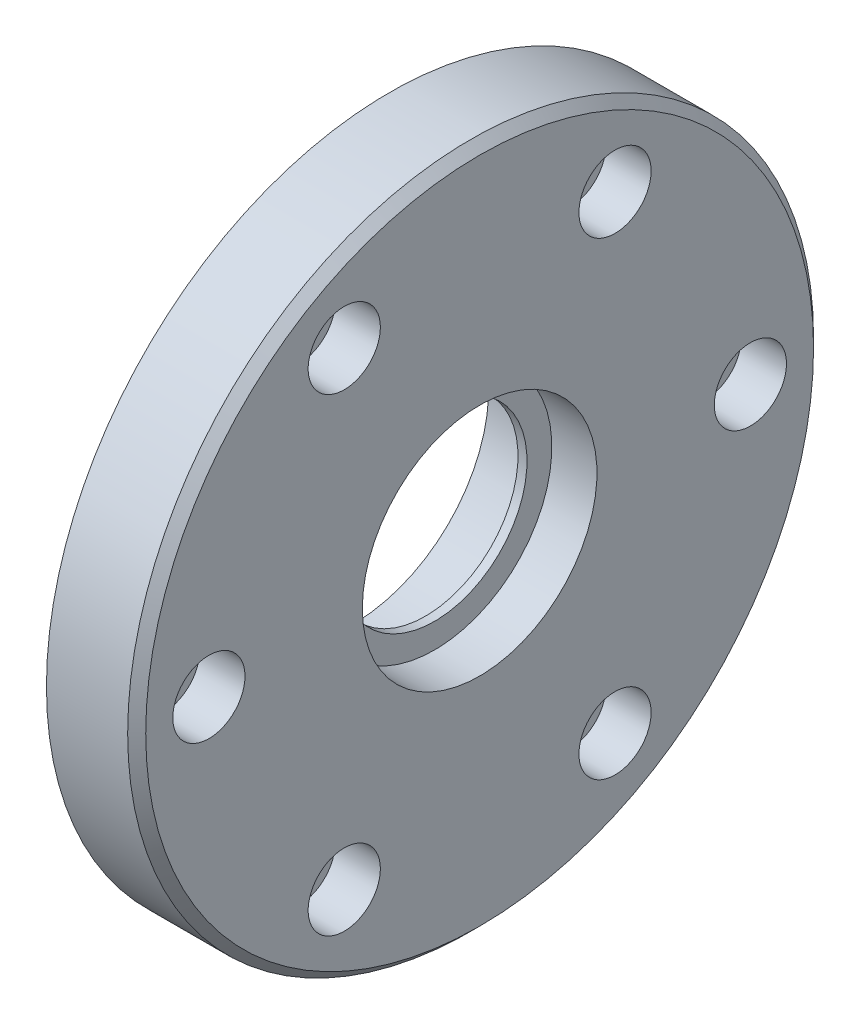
ISO-10303-21;
HEADER;
FILE_DESCRIPTION(('STEP AP214'),'2;1');
FILE_NAME('part.step','',(''),(''),'','','');
FILE_SCHEMA(('AUTOMOTIVE_DESIGN { 1 0 10303 214 1 1 1 1 }'));
ENDSEC;
DATA;
#1=APPLICATION_CONTEXT('core data for automotive mechanical design processes');
#2=APPLICATION_PROTOCOL_DEFINITION('international standard','automotive_design',2000,#1);
#3=PRODUCT_CONTEXT('',#1,'mechanical');
#4=PRODUCT('Part','Part','',(#3));
#5=PRODUCT_RELATED_PRODUCT_CATEGORY('part','',(#4));
#6=PRODUCT_DEFINITION_FORMATION('','',#4);
#7=PRODUCT_DEFINITION_CONTEXT('part definition',#1,'design');
#8=PRODUCT_DEFINITION('design','',#6,#7);
#9=PRODUCT_DEFINITION_SHAPE('','',#8);
#10=(LENGTH_UNIT() NAMED_UNIT(*) SI_UNIT(.MILLI.,.METRE.));
#11=(NAMED_UNIT(*) PLANE_ANGLE_UNIT() SI_UNIT($,.RADIAN.));
#12=(NAMED_UNIT(*) SI_UNIT($,.STERADIAN.) SOLID_ANGLE_UNIT());
#13=UNCERTAINTY_MEASURE_WITH_UNIT(LENGTH_MEASURE(1.E-05),#10,'distance_accuracy_value','');
#14=(GEOMETRIC_REPRESENTATION_CONTEXT(3) GLOBAL_UNCERTAINTY_ASSIGNED_CONTEXT((#13)) GLOBAL_UNIT_ASSIGNED_CONTEXT((#10,
#11,#12)) REPRESENTATION_CONTEXT('',''));
#15=CARTESIAN_POINT('',(0.,0.,0.));
#16=DIRECTION('',(0.,0.,1.));
#17=DIRECTION('',(1.,0.,0.));
#18=AXIS2_PLACEMENT_3D('',#15,#16,#17);
#19=CARTESIAN_POINT('',(-4.,25.,0.));
#20=DIRECTION('',(1.,0.,0.));
#21=DIRECTION('',(0.,0.,-1.));
#22=AXIS2_PLACEMENT_3D('',#19,#20,#21);
#23=PLANE('',#22);
#24=CARTESIAN_POINT('',(-4.,0.,0.));
#25=DIRECTION('',(1.,0.,0.));
#26=DIRECTION('',(0.,0.,-1.));
#27=AXIS2_PLACEMENT_3D('',#24,#25,#26);
#28=CIRCLE('',#27,24.5);
#29=CARTESIAN_POINT('',(-4.,0.,-24.5));
#30=VERTEX_POINT('',#29);
#31=EDGE_CURVE('E40',#30,#30,#28,.F.);
#32=ORIENTED_EDGE('',*,*,#31,.T.);
#33=EDGE_LOOP('',(#32));
#34=FACE_BOUND('',#33,.T.);
#35=CARTESIAN_POINT('',(-4.,0.,0.));
#36=DIRECTION('',(-1.,0.,0.));
#37=DIRECTION('',(0.,0.,1.));
#38=AXIS2_PLACEMENT_3D('',#35,#36,#37);
#39=CIRCLE('',#38,15.);
#40=CARTESIAN_POINT('',(-4.,0.,15.));
#41=VERTEX_POINT('',#40);
#42=EDGE_CURVE('E84',#41,#41,#39,.T.);
#43=ORIENTED_EDGE('',*,*,#42,.F.);
#44=EDGE_LOOP('',(#43));
#45=FACE_BOUND('',#44,.T.);
#46=ADVANCED_FACE('F33',(#34,#45),#23,.F.);
#47=CARTESIAN_POINT('',(0.,0.,0.));
#48=DIRECTION('',(-1.,0.,0.));
#49=DIRECTION('',(0.,0.,1.));
#50=AXIS2_PLACEMENT_3D('',#47,#48,#49);
#51=CYLINDRICAL_SURFACE('',#50,15.);
#52=CARTESIAN_POINT('',(4.,0.,0.));
#53=DIRECTION('',(-1.,0.,0.));
#54=DIRECTION('',(0.,0.,1.));
#55=AXIS2_PLACEMENT_3D('',#52,#53,#54);
#56=CIRCLE('',#55,15.);
#57=CARTESIAN_POINT('',(4.,0.,15.));
#58=VERTEX_POINT('',#57);
#59=EDGE_CURVE('E87',#58,#58,#56,.T.);
#60=ORIENTED_EDGE('',*,*,#59,.F.);
#61=EDGE_LOOP('',(#60));
#62=FACE_BOUND('',#61,.T.);
#63=ORIENTED_EDGE('',*,*,#42,.T.);
#64=EDGE_LOOP('',(#63));
#65=FACE_BOUND('',#64,.T.);
#66=ADVANCED_FACE('F219',(#62,#65),#51,.F.);
#67=CARTESIAN_POINT('',(4.,15.,0.));
#68=DIRECTION('',(1.,0.,0.));
#69=DIRECTION('',(0.,0.,-1.));
#70=AXIS2_PLACEMENT_3D('',#67,#68,#69);
#71=PLANE('',#70);
#72=CARTESIAN_POINT('',(4.,0.,0.));
#73=DIRECTION('',(-1.,0.,0.));
#74=DIRECTION('',(0.,0.,1.));
#75=AXIS2_PLACEMENT_3D('',#72,#73,#74);
#76=CIRCLE('',#75,10.25);
#77=CARTESIAN_POINT('',(4.,0.,10.25));
#78=VERTEX_POINT('',#77);
#79=EDGE_CURVE('E90',#78,#78,#76,.T.);
#80=ORIENTED_EDGE('',*,*,#79,.F.);
#81=EDGE_LOOP('',(#80));
#82=FACE_BOUND('',#81,.T.);
#83=ORIENTED_EDGE('',*,*,#59,.T.);
#84=EDGE_LOOP('',(#83));
#85=FACE_BOUND('',#84,.T.);
#86=ADVANCED_FACE('F213',(#82,#85),#71,.F.);
#87=CARTESIAN_POINT('',(0.,0.,0.));
#88=DIRECTION('',(-1.,0.,0.));
#89=DIRECTION('',(0.,0.,1.));
#90=AXIS2_PLACEMENT_3D('',#87,#88,#89);
#91=CYLINDRICAL_SURFACE('',#90,10.25);
#92=CARTESIAN_POINT('',(5.,0.,0.));
#93=DIRECTION('',(-1.,0.,0.));
#94=DIRECTION('',(0.,0.,1.));
#95=AXIS2_PLACEMENT_3D('',#92,#93,#94);
#96=CIRCLE('',#95,10.25);
#97=CARTESIAN_POINT('',(5.,0.,10.25));
#98=VERTEX_POINT('',#97);
#99=EDGE_CURVE('E93',#98,#98,#96,.T.);
#100=ORIENTED_EDGE('',*,*,#99,.F.);
#101=EDGE_LOOP('',(#100));
#102=FACE_BOUND('',#101,.T.);
#103=ORIENTED_EDGE('',*,*,#79,.T.);
#104=EDGE_LOOP('',(#103));
#105=FACE_BOUND('',#104,.T.);
#106=ADVANCED_FACE('F207',(#102,#105),#91,.F.);
#107=CARTESIAN_POINT('',(5.,10.25,0.));
#108=DIRECTION('',(-1.,0.,0.));
#109=DIRECTION('',(0.,0.,1.));
#110=AXIS2_PLACEMENT_3D('',#107,#108,#109);
#111=PLANE('',#110);
#112=CARTESIAN_POINT('',(5.,0.,0.));
#113=DIRECTION('',(-1.,0.,0.));
#114=DIRECTION('',(0.,0.,1.));
#115=AXIS2_PLACEMENT_3D('',#112,#113,#114);
#116=CIRCLE('',#115,13.);
#117=CARTESIAN_POINT('',(5.,0.,13.));
#118=VERTEX_POINT('',#117);
#119=EDGE_CURVE('E96',#118,#118,#116,.T.);
#120=ORIENTED_EDGE('',*,*,#119,.F.);
#121=EDGE_LOOP('',(#120));
#122=FACE_BOUND('',#121,.T.);
#123=ORIENTED_EDGE('',*,*,#99,.T.);
#124=EDGE_LOOP('',(#123));
#125=FACE_BOUND('',#124,.T.);
#126=ADVANCED_FACE('F201',(#122,#125),#111,.F.);
#127=CARTESIAN_POINT('',(0.,0.,0.));
#128=DIRECTION('',(-1.,0.,0.));
#129=DIRECTION('',(0.,0.,1.));
#130=AXIS2_PLACEMENT_3D('',#127,#128,#129);
#131=CYLINDRICAL_SURFACE('',#130,13.);
#132=CARTESIAN_POINT('',(10.,0.,0.));
#133=DIRECTION('',(-1.,0.,0.));
#134=DIRECTION('',(0.,0.,1.));
#135=AXIS2_PLACEMENT_3D('',#132,#133,#134);
#136=CIRCLE('',#135,13.);
#137=CARTESIAN_POINT('',(10.,0.,13.));
#138=VERTEX_POINT('',#137);
#139=EDGE_CURVE('E99',#138,#138,#136,.T.);
#140=ORIENTED_EDGE('',*,*,#139,.F.);
#141=EDGE_LOOP('',(#140));
#142=FACE_BOUND('',#141,.T.);
#143=ORIENTED_EDGE('',*,*,#119,.T.);
#144=EDGE_LOOP('',(#143));
#145=FACE_BOUND('',#144,.T.);
#146=ADVANCED_FACE('F183',(#142,#145),#131,.F.);
#147=CARTESIAN_POINT('',(10.,13.,0.));
#148=DIRECTION('',(-1.,0.,0.));
#149=DIRECTION('',(0.,0.,1.));
#150=AXIS2_PLACEMENT_3D('',#147,#148,#149);
#151=PLANE('',#150);
#152=CARTESIAN_POINT('',(10.,-25.980762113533,-15.0000000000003));
#153=DIRECTION('',(1.,0.,0.));
#154=DIRECTION('',(0.,0.,-1.));
#155=AXIS2_PLACEMENT_3D('',#152,#153,#154);
#156=CIRCLE('',#155,3.99999999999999);
#157=CARTESIAN_POINT('',(10.,-25.980762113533,-19.0000000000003));
#158=VERTEX_POINT('',#157);
#159=EDGE_CURVE('E56',#158,#158,#156,.T.);
#160=ORIENTED_EDGE('',*,*,#159,.F.);
#161=EDGE_LOOP('',(#160));
#162=FACE_BOUND('',#161,.T.);
#163=CARTESIAN_POINT('',(10.,-25.9807621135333,14.9999999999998));
#164=DIRECTION('',(1.,0.,0.));
#165=DIRECTION('',(0.,0.,-1.));
#166=AXIS2_PLACEMENT_3D('',#163,#164,#165);
#167=CIRCLE('',#166,3.99999999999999);
#168=CARTESIAN_POINT('',(10.,-25.9807621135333,10.9999999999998));
#169=VERTEX_POINT('',#168);
#170=EDGE_CURVE('E61',#169,#169,#167,.T.);
#171=ORIENTED_EDGE('',*,*,#170,.F.);
#172=EDGE_LOOP('',(#171));
#173=FACE_BOUND('',#172,.T.);
#174=CARTESIAN_POINT('',(10.,-2.09492430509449E-13,30.));
#175=DIRECTION('',(1.,0.,0.));
#176=DIRECTION('',(0.,0.,-1.));
#177=AXIS2_PLACEMENT_3D('',#174,#175,#176);
#178=CIRCLE('',#177,3.99999999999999);
#179=CARTESIAN_POINT('',(10.,-2.09492430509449E-13,26.));
#180=VERTEX_POINT('',#179);
#181=EDGE_CURVE('E66',#180,#180,#178,.T.);
#182=ORIENTED_EDGE('',*,*,#181,.F.);
#183=EDGE_LOOP('',(#182));
#184=FACE_BOUND('',#183,.T.);
#185=CARTESIAN_POINT('',(10.,25.9807621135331,15.0000000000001));
#186=DIRECTION('',(1.,0.,0.));
#187=DIRECTION('',(0.,0.,-1.));
#188=AXIS2_PLACEMENT_3D('',#185,#186,#187);
#189=CIRCLE('',#188,3.99999999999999);
#190=CARTESIAN_POINT('',(10.,25.9807621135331,11.0000000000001));
#191=VERTEX_POINT('',#190);
#192=EDGE_CURVE('E71',#191,#191,#189,.T.);
#193=ORIENTED_EDGE('',*,*,#192,.F.);
#194=EDGE_LOOP('',(#193));
#195=FACE_BOUND('',#194,.T.);
#196=CARTESIAN_POINT('',(10.,25.9807621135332,-14.9999999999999));
#197=DIRECTION('',(1.,0.,0.));
#198=DIRECTION('',(0.,0.,-1.));
#199=AXIS2_PLACEMENT_3D('',#196,#197,#198);
#200=CIRCLE('',#199,3.99999999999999);
#201=CARTESIAN_POINT('',(10.,25.9807621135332,-18.9999999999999));
#202=VERTEX_POINT('',#201);
#203=EDGE_CURVE('E76',#202,#202,#200,.T.);
#204=ORIENTED_EDGE('',*,*,#203,.F.);
#205=EDGE_LOOP('',(#204));
#206=FACE_BOUND('',#205,.T.);
#207=CARTESIAN_POINT('',(10.,0.,-30.));
#208=DIRECTION('',(1.,0.,0.));
#209=DIRECTION('',(0.,0.,-1.));
#210=AXIS2_PLACEMENT_3D('',#207,#208,#209);
#211=CIRCLE('',#210,3.99999999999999);
#212=CARTESIAN_POINT('',(10.,0.,-34.));
#213=VERTEX_POINT('',#212);
#214=EDGE_CURVE('E80',#213,#213,#211,.T.);
#215=ORIENTED_EDGE('',*,*,#214,.F.);
#216=EDGE_LOOP('',(#215));
#217=FACE_BOUND('',#216,.T.);
#218=CARTESIAN_POINT('',(10.,0.,0.));
#219=DIRECTION('',(-1.,0.,0.));
#220=DIRECTION('',(0.,0.,1.));
#221=AXIS2_PLACEMENT_3D('',#218,#219,#220);
#222=CIRCLE('',#221,37.);
#223=CARTESIAN_POINT('',(10.,0.,37.));
#224=VERTEX_POINT('',#223);
#225=EDGE_CURVE('E45',#224,#224,#222,.F.);
#226=ORIENTED_EDGE('',*,*,#225,.T.);
#227=EDGE_LOOP('',(#226));
#228=FACE_BOUND('',#227,.T.);
#229=ORIENTED_EDGE('',*,*,#139,.T.);
#230=EDGE_LOOP('',(#229));
#231=FACE_BOUND('',#230,.T.);
#232=ADVANCED_FACE('F179',(#162,#173,#184,#195,#206,#217,#228,#231),#151,.F.);
#233=CARTESIAN_POINT('',(0.,0.,0.));
#234=DIRECTION('',(-1.,0.,0.));
#235=DIRECTION('',(0.,0.,1.));
#236=AXIS2_PLACEMENT_3D('',#233,#234,#235);
#237=CYLINDRICAL_SURFACE('',#236,38.);
#238=CARTESIAN_POINT('',(9.,0.,0.));
#239=DIRECTION('',(-1.,0.,0.));
#240=DIRECTION('',(0.,0.,1.));
#241=AXIS2_PLACEMENT_3D('',#238,#239,#240);
#242=CIRCLE('',#241,38.);
#243=CARTESIAN_POINT('',(9.,0.,38.));
#244=VERTEX_POINT('',#243);
#245=EDGE_CURVE('E49',#244,#244,#242,.T.);
#246=ORIENTED_EDGE('',*,*,#245,.T.);
#247=EDGE_LOOP('',(#246));
#248=FACE_BOUND('',#247,.T.);
#249=CARTESIAN_POINT('',(0.,0.,0.));
#250=DIRECTION('',(-1.,0.,0.));
#251=DIRECTION('',(0.,0.,1.));
#252=AXIS2_PLACEMENT_3D('',#249,#250,#251);
#253=CIRCLE('',#252,38.);
#254=CARTESIAN_POINT('',(0.,0.,38.));
#255=VERTEX_POINT('',#254);
#256=EDGE_CURVE('E102',#255,#255,#253,.T.);
#257=ORIENTED_EDGE('',*,*,#256,.F.);
#258=EDGE_LOOP('',(#257));
#259=FACE_BOUND('',#258,.T.);
#260=ADVANCED_FACE('F182',(#248,#259),#237,.T.);
#261=CARTESIAN_POINT('',(0.,38.,0.));
#262=DIRECTION('',(1.,0.,0.));
#263=DIRECTION('',(0.,0.,-1.));
#264=AXIS2_PLACEMENT_3D('',#261,#262,#263);
#265=PLANE('',#264);
#266=CARTESIAN_POINT('',(0.,-25.980762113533,-15.0000000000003));
#267=DIRECTION('',(1.,0.,0.));
#268=DIRECTION('',(0.,0.,-1.));
#269=AXIS2_PLACEMENT_3D('',#266,#267,#268);
#270=CIRCLE('',#269,2.15);
#271=CARTESIAN_POINT('',(0.,-25.980762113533,-17.1500000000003));
#272=VERTEX_POINT('',#271);
#273=EDGE_CURVE('E52',#272,#272,#270,.T.);
#274=ORIENTED_EDGE('',*,*,#273,.T.);
#275=EDGE_LOOP('',(#274));
#276=FACE_BOUND('',#275,.T.);
#277=CARTESIAN_POINT('',(0.,-25.9807621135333,14.9999999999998));
#278=DIRECTION('',(1.,0.,0.));
#279=DIRECTION('',(0.,0.,-1.));
#280=AXIS2_PLACEMENT_3D('',#277,#278,#279);
#281=CIRCLE('',#280,2.15);
#282=CARTESIAN_POINT('',(0.,-25.9807621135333,12.8499999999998));
#283=VERTEX_POINT('',#282);
#284=EDGE_CURVE('E57',#283,#283,#281,.T.);
#285=ORIENTED_EDGE('',*,*,#284,.T.);
#286=EDGE_LOOP('',(#285));
#287=FACE_BOUND('',#286,.T.);
#288=CARTESIAN_POINT('',(0.,-2.09492430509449E-13,30.));
#289=DIRECTION('',(1.,0.,0.));
#290=DIRECTION('',(0.,0.,-1.));
#291=AXIS2_PLACEMENT_3D('',#288,#289,#290);
#292=CIRCLE('',#291,2.15);
#293=CARTESIAN_POINT('',(0.,-2.09492430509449E-13,27.85));
#294=VERTEX_POINT('',#293);
#295=EDGE_CURVE('E62',#294,#294,#292,.T.);
#296=ORIENTED_EDGE('',*,*,#295,.T.);
#297=EDGE_LOOP('',(#296));
#298=FACE_BOUND('',#297,.T.);
#299=CARTESIAN_POINT('',(0.,25.9807621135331,15.0000000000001));
#300=DIRECTION('',(1.,0.,0.));
#301=DIRECTION('',(0.,0.,-1.));
#302=AXIS2_PLACEMENT_3D('',#299,#300,#301);
#303=CIRCLE('',#302,2.15);
#304=CARTESIAN_POINT('',(0.,25.9807621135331,12.8500000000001));
#305=VERTEX_POINT('',#304);
#306=EDGE_CURVE('E67',#305,#305,#303,.T.);
#307=ORIENTED_EDGE('',*,*,#306,.T.);
#308=EDGE_LOOP('',(#307));
#309=FACE_BOUND('',#308,.T.);
#310=CARTESIAN_POINT('',(0.,25.9807621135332,-14.9999999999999));
#311=DIRECTION('',(1.,0.,0.));
#312=DIRECTION('',(0.,0.,-1.));
#313=AXIS2_PLACEMENT_3D('',#310,#311,#312);
#314=CIRCLE('',#313,2.15);
#315=CARTESIAN_POINT('',(0.,25.9807621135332,-17.1499999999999));
#316=VERTEX_POINT('',#315);
#317=EDGE_CURVE('E72',#316,#316,#314,.T.);
#318=ORIENTED_EDGE('',*,*,#317,.T.);
#319=EDGE_LOOP('',(#318));
#320=FACE_BOUND('',#319,.T.);
#321=CARTESIAN_POINT('',(0.,0.,-30.));
#322=DIRECTION('',(1.,0.,0.));
#323=DIRECTION('',(0.,0.,-1.));
#324=AXIS2_PLACEMENT_3D('',#321,#322,#323);
#325=CIRCLE('',#324,2.15);
#326=CARTESIAN_POINT('',(0.,0.,-32.15));
#327=VERTEX_POINT('',#326);
#328=EDGE_CURVE('E77',#327,#327,#325,.T.);
#329=ORIENTED_EDGE('',*,*,#328,.T.);
#330=EDGE_LOOP('',(#329));
#331=FACE_BOUND('',#330,.T.);
#332=CARTESIAN_POINT('',(0.,0.,0.));
#333=DIRECTION('',(-1.,0.,0.));
#334=DIRECTION('',(0.,0.,1.));
#335=AXIS2_PLACEMENT_3D('',#332,#333,#334);
#336=CIRCLE('',#335,25.);
#337=CARTESIAN_POINT('',(0.,0.,25.));
#338=VERTEX_POINT('',#337);
#339=EDGE_CURVE('E105',#338,#338,#336,.T.);
#340=ORIENTED_EDGE('',*,*,#339,.F.);
#341=EDGE_LOOP('',(#340));
#342=FACE_BOUND('',#341,.T.);
#343=ORIENTED_EDGE('',*,*,#256,.T.);
#344=EDGE_LOOP('',(#343));
#345=FACE_BOUND('',#344,.T.);
#346=ADVANCED_FACE('F260',(#276,#287,#298,#309,#320,#331,#342,#345),#265,.F.);
#347=CARTESIAN_POINT('',(0.,0.,0.));
#348=DIRECTION('',(-1.,0.,0.));
#349=DIRECTION('',(0.,0.,1.));
#350=AXIS2_PLACEMENT_3D('',#347,#348,#349);
#351=CYLINDRICAL_SURFACE('',#350,25.);
#352=CARTESIAN_POINT('',(-1.,0.,0.));
#353=DIRECTION('',(-1.,0.,0.));
#354=DIRECTION('',(0.,0.,1.));
#355=AXIS2_PLACEMENT_3D('',#352,#353,#354);
#356=CIRCLE('',#355,25.);
#357=CARTESIAN_POINT('',(-1.,0.,25.));
#358=VERTEX_POINT('',#357);
#359=EDGE_CURVE('E108',#358,#358,#356,.T.);
#360=ORIENTED_EDGE('',*,*,#359,.F.);
#361=EDGE_LOOP('',(#360));
#362=FACE_BOUND('',#361,.T.);
#363=ORIENTED_EDGE('',*,*,#339,.T.);
#364=EDGE_LOOP('',(#363));
#365=FACE_BOUND('',#364,.T.);
#366=ADVANCED_FACE('F268',(#362,#365),#351,.T.);
#367=CARTESIAN_POINT('',(-1.,25.,0.));
#368=DIRECTION('',(1.,0.,0.));
#369=DIRECTION('',(0.,0.,-1.));
#370=AXIS2_PLACEMENT_3D('',#367,#368,#369);
#371=PLANE('',#370);
#372=CARTESIAN_POINT('',(-0.999999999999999,0.,0.));
#373=DIRECTION('',(-1.,0.,0.));
#374=DIRECTION('',(0.,0.,1.));
#375=AXIS2_PLACEMENT_3D('',#372,#373,#374);
#376=CIRCLE('',#375,24.);
#377=CARTESIAN_POINT('',(-0.999999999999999,0.,24.));
#378=VERTEX_POINT('',#377);
#379=EDGE_CURVE('E111',#378,#378,#376,.T.);
#380=ORIENTED_EDGE('',*,*,#379,.F.);
#381=EDGE_LOOP('',(#380));
#382=FACE_BOUND('',#381,.T.);
#383=ORIENTED_EDGE('',*,*,#359,.T.);
#384=EDGE_LOOP('',(#383));
#385=FACE_BOUND('',#384,.T.);
#386=ADVANCED_FACE('F276',(#382,#385),#371,.F.);
#387=CARTESIAN_POINT('',(0.,0.,0.));
#388=DIRECTION('',(-1.,0.,0.));
#389=DIRECTION('',(0.,0.,1.));
#390=AXIS2_PLACEMENT_3D('',#387,#388,#389);
#391=CYLINDRICAL_SURFACE('',#390,24.);
#392=CARTESIAN_POINT('',(-2.5,0.,0.));
#393=DIRECTION('',(-1.,0.,0.));
#394=DIRECTION('',(0.,0.,1.));
#395=AXIS2_PLACEMENT_3D('',#392,#393,#394);
#396=CIRCLE('',#395,24.);
#397=CARTESIAN_POINT('',(-2.5,0.,24.));
#398=VERTEX_POINT('',#397);
#399=EDGE_CURVE('E114',#398,#398,#396,.T.);
#400=ORIENTED_EDGE('',*,*,#399,.F.);
#401=EDGE_LOOP('',(#400));
#402=FACE_BOUND('',#401,.T.);
#403=ORIENTED_EDGE('',*,*,#379,.T.);
#404=EDGE_LOOP('',(#403));
#405=FACE_BOUND('',#404,.T.);
#406=ADVANCED_FACE('F284',(#402,#405),#391,.T.);
#407=CARTESIAN_POINT('',(-2.5,25.,0.));
#408=DIRECTION('',(-1.,0.,0.));
#409=DIRECTION('',(0.,0.,1.));
#410=AXIS2_PLACEMENT_3D('',#407,#408,#409);
#411=PLANE('',#410);
#412=CARTESIAN_POINT('',(-2.5,0.,0.));
#413=DIRECTION('',(-1.,0.,0.));
#414=DIRECTION('',(0.,0.,1.));
#415=AXIS2_PLACEMENT_3D('',#412,#413,#414);
#416=CIRCLE('',#415,25.);
#417=CARTESIAN_POINT('',(-2.5,0.,25.));
#418=VERTEX_POINT('',#417);
#419=EDGE_CURVE('E79',#418,#418,#416,.T.);
#420=ORIENTED_EDGE('',*,*,#419,.F.);
#421=EDGE_LOOP('',(#420));
#422=FACE_BOUND('',#421,.T.);
#423=ORIENTED_EDGE('',*,*,#399,.T.);
#424=EDGE_LOOP('',(#423));
#425=FACE_BOUND('',#424,.T.);
#426=ADVANCED_FACE('F292',(#422,#425),#411,.F.);
#427=CARTESIAN_POINT('',(0.,0.,0.));
#428=DIRECTION('',(-1.,0.,0.));
#429=DIRECTION('',(0.,0.,1.));
#430=AXIS2_PLACEMENT_3D('',#427,#428,#429);
#431=CYLINDRICAL_SURFACE('',#430,25.);
#432=CARTESIAN_POINT('',(-3.5,0.,0.));
#433=DIRECTION('',(1.,0.,0.));
#434=DIRECTION('',(0.,0.,-1.));
#435=AXIS2_PLACEMENT_3D('',#432,#433,#434);
#436=CIRCLE('',#435,25.);
#437=CARTESIAN_POINT('',(-3.5,0.,-25.));
#438=VERTEX_POINT('',#437);
#439=EDGE_CURVE('E10',#438,#438,#436,.T.);
#440=ORIENTED_EDGE('',*,*,#439,.T.);
#441=EDGE_LOOP('',(#440));
#442=FACE_BOUND('',#441,.T.);
#443=ORIENTED_EDGE('',*,*,#419,.T.);
#444=EDGE_LOOP('',(#443));
#445=FACE_BOUND('',#444,.T.);
#446=ADVANCED_FACE('F300',(#442,#445),#431,.T.);
#447=CARTESIAN_POINT('',(9.,0.,0.));
#448=DIRECTION('',(-1.,0.,0.));
#449=DIRECTION('',(0.,0.,1.));
#450=AXIS2_PLACEMENT_3D('',#447,#448,#449);
#451=CONICAL_SURFACE('',#450,38.,0.785398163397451);
#452=ORIENTED_EDGE('',*,*,#225,.F.);
#453=EDGE_LOOP('',(#452));
#454=FACE_BOUND('',#453,.T.);
#455=ORIENTED_EDGE('',*,*,#245,.F.);
#456=EDGE_LOOP('',(#455));
#457=FACE_BOUND('',#456,.T.);
#458=ADVANCED_FACE('F308',(#454,#457),#451,.T.);
#459=CARTESIAN_POINT('',(10.,0.,-30.));
#460=DIRECTION('',(1.,0.,0.));
#461=DIRECTION('',(0.,0.,-1.));
#462=AXIS2_PLACEMENT_3D('',#459,#460,#461);
#463=CYLINDRICAL_SURFACE('',#462,2.15);
#464=CARTESIAN_POINT('',(5.,0.,-30.));
#465=DIRECTION('',(1.,0.,0.));
#466=DIRECTION('',(0.,0.,-1.));
#467=AXIS2_PLACEMENT_3D('',#464,#465,#466);
#468=CIRCLE('',#467,2.15);
#469=CARTESIAN_POINT('',(5.,0.,-32.15));
#470=VERTEX_POINT('',#469);
#471=EDGE_CURVE('E75',#470,#470,#468,.T.);
#472=ORIENTED_EDGE('',*,*,#471,.T.);
#473=EDGE_LOOP('',(#472));
#474=FACE_BOUND('',#473,.T.);
#475=ORIENTED_EDGE('',*,*,#328,.F.);
#476=EDGE_LOOP('',(#475));
#477=FACE_BOUND('',#476,.T.);
#478=ADVANCED_FACE('F315',(#474,#477),#463,.F.);
#479=CARTESIAN_POINT('',(10.,0.,-30.));
#480=DIRECTION('',(1.,0.,0.));
#481=DIRECTION('',(0.,0.,-1.));
#482=AXIS2_PLACEMENT_3D('',#479,#480,#481);
#483=CYLINDRICAL_SURFACE('',#482,3.99999999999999);
#484=CARTESIAN_POINT('',(5.,0.,-30.));
#485=DIRECTION('',(1.,0.,0.));
#486=DIRECTION('',(0.,0.,-1.));
#487=AXIS2_PLACEMENT_3D('',#484,#485,#486);
#488=CIRCLE('',#487,4.);
#489=CARTESIAN_POINT('',(5.,0.,-34.));
#490=VERTEX_POINT('',#489);
#491=EDGE_CURVE('E121',#490,#490,#488,.T.);
#492=ORIENTED_EDGE('',*,*,#491,.F.);
#493=EDGE_LOOP('',(#492));
#494=FACE_BOUND('',#493,.T.);
#495=ORIENTED_EDGE('',*,*,#214,.T.);
#496=EDGE_LOOP('',(#495));
#497=FACE_BOUND('',#496,.T.);
#498=ADVANCED_FACE('F323',(#494,#497),#483,.F.);
#499=CARTESIAN_POINT('',(5.,2.15,-30.));
#500=DIRECTION('',(-1.,0.,0.));
#501=DIRECTION('',(0.,0.,1.));
#502=AXIS2_PLACEMENT_3D('',#499,#500,#501);
#503=PLANE('',#502);
#504=ORIENTED_EDGE('',*,*,#471,.F.);
#505=EDGE_LOOP('',(#504));
#506=FACE_BOUND('',#505,.T.);
#507=ORIENTED_EDGE('',*,*,#491,.T.);
#508=EDGE_LOOP('',(#507));
#509=FACE_BOUND('',#508,.T.);
#510=ADVANCED_FACE('F331',(#506,#509),#503,.F.);
#511=CARTESIAN_POINT('',(10.,25.9807621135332,-14.9999999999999));
#512=DIRECTION('',(1.,0.,0.));
#513=DIRECTION('',(0.,0.,-1.));
#514=AXIS2_PLACEMENT_3D('',#511,#512,#513);
#515=CYLINDRICAL_SURFACE('',#514,2.15);
#516=CARTESIAN_POINT('',(5.,25.9807621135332,-14.9999999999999));
#517=DIRECTION('',(1.,0.,0.));
#518=DIRECTION('',(0.,0.,-1.));
#519=AXIS2_PLACEMENT_3D('',#516,#517,#518);
#520=CIRCLE('',#519,2.15);
#521=CARTESIAN_POINT('',(5.,25.9807621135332,-17.1499999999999));
#522=VERTEX_POINT('',#521);
#523=EDGE_CURVE('E70',#522,#522,#520,.T.);
#524=ORIENTED_EDGE('',*,*,#523,.T.);
#525=EDGE_LOOP('',(#524));
#526=FACE_BOUND('',#525,.T.);
#527=ORIENTED_EDGE('',*,*,#317,.F.);
#528=EDGE_LOOP('',(#527));
#529=FACE_BOUND('',#528,.T.);
#530=ADVANCED_FACE('F339',(#526,#529),#515,.F.);
#531=CARTESIAN_POINT('',(10.,25.9807621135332,-14.9999999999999));
#532=DIRECTION('',(1.,0.,0.));
#533=DIRECTION('',(0.,0.,-1.));
#534=AXIS2_PLACEMENT_3D('',#531,#532,#533);
#535=CYLINDRICAL_SURFACE('',#534,3.99999999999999);
#536=CARTESIAN_POINT('',(5.,25.9807621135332,-14.9999999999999));
#537=DIRECTION('',(1.,0.,0.));
#538=DIRECTION('',(0.,0.,-1.));
#539=AXIS2_PLACEMENT_3D('',#536,#537,#538);
#540=CIRCLE('',#539,4.);
#541=CARTESIAN_POINT('',(5.,25.9807621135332,-18.9999999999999));
#542=VERTEX_POINT('',#541);
#543=EDGE_CURVE('E128',#542,#542,#540,.T.);
#544=ORIENTED_EDGE('',*,*,#543,.F.);
#545=EDGE_LOOP('',(#544));
#546=FACE_BOUND('',#545,.T.);
#547=ORIENTED_EDGE('',*,*,#203,.T.);
#548=EDGE_LOOP('',(#547));
#549=FACE_BOUND('',#548,.T.);
#550=ADVANCED_FACE('F347',(#546,#549),#535,.F.);
#551=CARTESIAN_POINT('',(5.,28.1307621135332,-14.9999999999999));
#552=DIRECTION('',(-1.,0.,0.));
#553=DIRECTION('',(0.,0.,1.));
#554=AXIS2_PLACEMENT_3D('',#551,#552,#553);
#555=PLANE('',#554);
#556=ORIENTED_EDGE('',*,*,#523,.F.);
#557=EDGE_LOOP('',(#556));
#558=FACE_BOUND('',#557,.T.);
#559=ORIENTED_EDGE('',*,*,#543,.T.);
#560=EDGE_LOOP('',(#559));
#561=FACE_BOUND('',#560,.T.);
#562=ADVANCED_FACE('F355',(#558,#561),#555,.F.);
#563=CARTESIAN_POINT('',(10.,25.9807621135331,15.0000000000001));
#564=DIRECTION('',(1.,0.,0.));
#565=DIRECTION('',(0.,0.,-1.));
#566=AXIS2_PLACEMENT_3D('',#563,#564,#565);
#567=CYLINDRICAL_SURFACE('',#566,2.15);
#568=CARTESIAN_POINT('',(5.,25.9807621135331,15.0000000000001));
#569=DIRECTION('',(1.,0.,0.));
#570=DIRECTION('',(0.,0.,-1.));
#571=AXIS2_PLACEMENT_3D('',#568,#569,#570);
#572=CIRCLE('',#571,2.15);
#573=CARTESIAN_POINT('',(5.,25.9807621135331,12.8500000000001));
#574=VERTEX_POINT('',#573);
#575=EDGE_CURVE('E65',#574,#574,#572,.T.);
#576=ORIENTED_EDGE('',*,*,#575,.T.);
#577=EDGE_LOOP('',(#576));
#578=FACE_BOUND('',#577,.T.);
#579=ORIENTED_EDGE('',*,*,#306,.F.);
#580=EDGE_LOOP('',(#579));
#581=FACE_BOUND('',#580,.T.);
#582=ADVANCED_FACE('F363',(#578,#581),#567,.F.);
#583=CARTESIAN_POINT('',(10.,25.9807621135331,15.0000000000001));
#584=DIRECTION('',(1.,0.,0.));
#585=DIRECTION('',(0.,0.,-1.));
#586=AXIS2_PLACEMENT_3D('',#583,#584,#585);
#587=CYLINDRICAL_SURFACE('',#586,3.99999999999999);
#588=CARTESIAN_POINT('',(5.,25.9807621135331,15.0000000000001));
#589=DIRECTION('',(1.,0.,0.));
#590=DIRECTION('',(0.,0.,-1.));
#591=AXIS2_PLACEMENT_3D('',#588,#589,#590);
#592=CIRCLE('',#591,4.);
#593=CARTESIAN_POINT('',(5.,25.9807621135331,11.0000000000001));
#594=VERTEX_POINT('',#593);
#595=EDGE_CURVE('E135',#594,#594,#592,.T.);
#596=ORIENTED_EDGE('',*,*,#595,.F.);
#597=EDGE_LOOP('',(#596));
#598=FACE_BOUND('',#597,.T.);
#599=ORIENTED_EDGE('',*,*,#192,.T.);
#600=EDGE_LOOP('',(#599));
#601=FACE_BOUND('',#600,.T.);
#602=ADVANCED_FACE('F371',(#598,#601),#587,.F.);
#603=CARTESIAN_POINT('',(5.,28.1307621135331,15.0000000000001));
#604=DIRECTION('',(-1.,0.,0.));
#605=DIRECTION('',(0.,0.,1.));
#606=AXIS2_PLACEMENT_3D('',#603,#604,#605);
#607=PLANE('',#606);
#608=ORIENTED_EDGE('',*,*,#575,.F.);
#609=EDGE_LOOP('',(#608));
#610=FACE_BOUND('',#609,.T.);
#611=ORIENTED_EDGE('',*,*,#595,.T.);
#612=EDGE_LOOP('',(#611));
#613=FACE_BOUND('',#612,.T.);
#614=ADVANCED_FACE('F379',(#610,#613),#607,.F.);
#615=CARTESIAN_POINT('',(10.,-2.09492430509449E-13,30.));
#616=DIRECTION('',(1.,0.,0.));
#617=DIRECTION('',(0.,0.,-1.));
#618=AXIS2_PLACEMENT_3D('',#615,#616,#617);
#619=CYLINDRICAL_SURFACE('',#618,2.15);
#620=CARTESIAN_POINT('',(5.,-2.09492430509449E-13,30.));
#621=DIRECTION('',(1.,0.,0.));
#622=DIRECTION('',(0.,0.,-1.));
#623=AXIS2_PLACEMENT_3D('',#620,#621,#622);
#624=CIRCLE('',#623,2.15);
#625=CARTESIAN_POINT('',(5.,-2.09492430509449E-13,27.85));
#626=VERTEX_POINT('',#625);
#627=EDGE_CURVE('E60',#626,#626,#624,.T.);
#628=ORIENTED_EDGE('',*,*,#627,.T.);
#629=EDGE_LOOP('',(#628));
#630=FACE_BOUND('',#629,.T.);
#631=ORIENTED_EDGE('',*,*,#295,.F.);
#632=EDGE_LOOP('',(#631));
#633=FACE_BOUND('',#632,.T.);
#634=ADVANCED_FACE('F387',(#630,#633),#619,.F.);
#635=CARTESIAN_POINT('',(10.,-2.09492430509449E-13,30.));
#636=DIRECTION('',(1.,0.,0.));
#637=DIRECTION('',(0.,0.,-1.));
#638=AXIS2_PLACEMENT_3D('',#635,#636,#637);
#639=CYLINDRICAL_SURFACE('',#638,3.99999999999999);
#640=CARTESIAN_POINT('',(5.,-2.09492430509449E-13,30.));
#641=DIRECTION('',(1.,0.,0.));
#642=DIRECTION('',(0.,0.,-1.));
#643=AXIS2_PLACEMENT_3D('',#640,#641,#642);
#644=CIRCLE('',#643,4.);
#645=CARTESIAN_POINT('',(5.,-2.09492430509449E-13,26.));
#646=VERTEX_POINT('',#645);
#647=EDGE_CURVE('E142',#646,#646,#644,.T.);
#648=ORIENTED_EDGE('',*,*,#647,.F.);
#649=EDGE_LOOP('',(#648));
#650=FACE_BOUND('',#649,.T.);
#651=ORIENTED_EDGE('',*,*,#181,.T.);
#652=EDGE_LOOP('',(#651));
#653=FACE_BOUND('',#652,.T.);
#654=ADVANCED_FACE('F395',(#650,#653),#639,.F.);
#655=CARTESIAN_POINT('',(5.,2.14999999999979,30.));
#656=DIRECTION('',(-1.,0.,0.));
#657=DIRECTION('',(0.,0.,1.));
#658=AXIS2_PLACEMENT_3D('',#655,#656,#657);
#659=PLANE('',#658);
#660=ORIENTED_EDGE('',*,*,#627,.F.);
#661=EDGE_LOOP('',(#660));
#662=FACE_BOUND('',#661,.T.);
#663=ORIENTED_EDGE('',*,*,#647,.T.);
#664=EDGE_LOOP('',(#663));
#665=FACE_BOUND('',#664,.T.);
#666=ADVANCED_FACE('F403',(#662,#665),#659,.F.);
#667=CARTESIAN_POINT('',(10.,-25.9807621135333,14.9999999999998));
#668=DIRECTION('',(1.,0.,0.));
#669=DIRECTION('',(0.,0.,-1.));
#670=AXIS2_PLACEMENT_3D('',#667,#668,#669);
#671=CYLINDRICAL_SURFACE('',#670,2.15);
#672=CARTESIAN_POINT('',(5.,-25.9807621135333,14.9999999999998));
#673=DIRECTION('',(1.,0.,0.));
#674=DIRECTION('',(0.,0.,-1.));
#675=AXIS2_PLACEMENT_3D('',#672,#673,#674);
#676=CIRCLE('',#675,2.15);
#677=CARTESIAN_POINT('',(5.,-25.9807621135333,12.8499999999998));
#678=VERTEX_POINT('',#677);
#679=EDGE_CURVE('E55',#678,#678,#676,.T.);
#680=ORIENTED_EDGE('',*,*,#679,.T.);
#681=EDGE_LOOP('',(#680));
#682=FACE_BOUND('',#681,.T.);
#683=ORIENTED_EDGE('',*,*,#284,.F.);
#684=EDGE_LOOP('',(#683));
#685=FACE_BOUND('',#684,.T.);
#686=ADVANCED_FACE('F411',(#682,#685),#671,.F.);
#687=CARTESIAN_POINT('',(10.,-25.9807621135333,14.9999999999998));
#688=DIRECTION('',(1.,0.,0.));
#689=DIRECTION('',(0.,0.,-1.));
#690=AXIS2_PLACEMENT_3D('',#687,#688,#689);
#691=CYLINDRICAL_SURFACE('',#690,3.99999999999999);
#692=CARTESIAN_POINT('',(5.,-25.9807621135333,14.9999999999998));
#693=DIRECTION('',(1.,0.,0.));
#694=DIRECTION('',(0.,0.,-1.));
#695=AXIS2_PLACEMENT_3D('',#692,#693,#694);
#696=CIRCLE('',#695,4.);
#697=CARTESIAN_POINT('',(5.,-25.9807621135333,10.9999999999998));
#698=VERTEX_POINT('',#697);
#699=EDGE_CURVE('E149',#698,#698,#696,.T.);
#700=ORIENTED_EDGE('',*,*,#699,.F.);
#701=EDGE_LOOP('',(#700));
#702=FACE_BOUND('',#701,.T.);
#703=ORIENTED_EDGE('',*,*,#170,.T.);
#704=EDGE_LOOP('',(#703));
#705=FACE_BOUND('',#704,.T.);
#706=ADVANCED_FACE('F419',(#702,#705),#691,.F.);
#707=CARTESIAN_POINT('',(5.,-23.8307621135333,14.9999999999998));
#708=DIRECTION('',(-1.,0.,0.));
#709=DIRECTION('',(0.,0.,1.));
#710=AXIS2_PLACEMENT_3D('',#707,#708,#709);
#711=PLANE('',#710);
#712=ORIENTED_EDGE('',*,*,#679,.F.);
#713=EDGE_LOOP('',(#712));
#714=FACE_BOUND('',#713,.T.);
#715=ORIENTED_EDGE('',*,*,#699,.T.);
#716=EDGE_LOOP('',(#715));
#717=FACE_BOUND('',#716,.T.);
#718=ADVANCED_FACE('F427',(#714,#717),#711,.F.);
#719=CARTESIAN_POINT('',(10.,-25.980762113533,-15.0000000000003));
#720=DIRECTION('',(1.,0.,0.));
#721=DIRECTION('',(0.,0.,-1.));
#722=AXIS2_PLACEMENT_3D('',#719,#720,#721);
#723=CYLINDRICAL_SURFACE('',#722,2.15);
#724=CARTESIAN_POINT('',(5.,-25.980762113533,-15.0000000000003));
#725=DIRECTION('',(1.,0.,0.));
#726=DIRECTION('',(0.,0.,-1.));
#727=AXIS2_PLACEMENT_3D('',#724,#725,#726);
#728=CIRCLE('',#727,2.15);
#729=CARTESIAN_POINT('',(5.,-25.980762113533,-17.1500000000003));
#730=VERTEX_POINT('',#729);
#731=EDGE_CURVE('E159',#730,#730,#728,.T.);
#732=ORIENTED_EDGE('',*,*,#731,.T.);
#733=EDGE_LOOP('',(#732));
#734=FACE_BOUND('',#733,.T.);
#735=ORIENTED_EDGE('',*,*,#273,.F.);
#736=EDGE_LOOP('',(#735));
#737=FACE_BOUND('',#736,.T.);
#738=ADVANCED_FACE('F163',(#734,#737),#723,.F.);
#739=CARTESIAN_POINT('',(10.,-25.980762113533,-15.0000000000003));
#740=DIRECTION('',(1.,0.,0.));
#741=DIRECTION('',(0.,0.,-1.));
#742=AXIS2_PLACEMENT_3D('',#739,#740,#741);
#743=CYLINDRICAL_SURFACE('',#742,3.99999999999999);
#744=CARTESIAN_POINT('',(5.,-25.980762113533,-15.0000000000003));
#745=DIRECTION('',(1.,0.,0.));
#746=DIRECTION('',(0.,0.,-1.));
#747=AXIS2_PLACEMENT_3D('',#744,#745,#746);
#748=CIRCLE('',#747,4.);
#749=CARTESIAN_POINT('',(5.,-25.980762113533,-19.0000000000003));
#750=VERTEX_POINT('',#749);
#751=EDGE_CURVE('E156',#750,#750,#748,.T.);
#752=ORIENTED_EDGE('',*,*,#751,.F.);
#753=EDGE_LOOP('',(#752));
#754=FACE_BOUND('',#753,.T.);
#755=ORIENTED_EDGE('',*,*,#159,.T.);
#756=EDGE_LOOP('',(#755));
#757=FACE_BOUND('',#756,.T.);
#758=ADVANCED_FACE('F170',(#754,#757),#743,.F.);
#759=CARTESIAN_POINT('',(5.,-23.830762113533,-15.0000000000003));
#760=DIRECTION('',(-1.,0.,0.));
#761=DIRECTION('',(0.,0.,1.));
#762=AXIS2_PLACEMENT_3D('',#759,#760,#761);
#763=PLANE('',#762);
#764=ORIENTED_EDGE('',*,*,#731,.F.);
#765=EDGE_LOOP('',(#764));
#766=FACE_BOUND('',#765,.T.);
#767=ORIENTED_EDGE('',*,*,#751,.T.);
#768=EDGE_LOOP('',(#767));
#769=FACE_BOUND('',#768,.T.);
#770=ADVANCED_FACE('F166',(#766,#769),#763,.F.);
#771=CARTESIAN_POINT('',(-4.,0.,0.));
#772=DIRECTION('',(1.,0.,0.));
#773=DIRECTION('',(0.,0.,-1.));
#774=AXIS2_PLACEMENT_3D('',#771,#772,#773);
#775=CONICAL_SURFACE('',#774,24.5,0.785398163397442);
#776=ORIENTED_EDGE('',*,*,#439,.F.);
#777=EDGE_LOOP('',(#776));
#778=FACE_BOUND('',#777,.T.);
#779=ORIENTED_EDGE('',*,*,#31,.F.);
#780=EDGE_LOOP('',(#779));
#781=FACE_BOUND('',#780,.T.);
#782=ADVANCED_FACE('F169',(#778,#781),#775,.T.);
#783=CLOSED_SHELL('',(#46,#66,#86,#106,#126,#146,#232,#260,#346,#366,#386,#406,#426,#446,#458,
#478,#498,#510,#530,#550,#562,#582,#602,#614,#634,#654,#666,#686,#706,#718,#738,#758,#770,#782));
#784=MANIFOLD_SOLID_BREP('B2',#783);
#785=ADVANCED_BREP_SHAPE_REPRESENTATION('',(#18,#784),#14);
#786=SHAPE_DEFINITION_REPRESENTATION(#9,#785);
ENDSEC;
END-ISO-10303-21;
